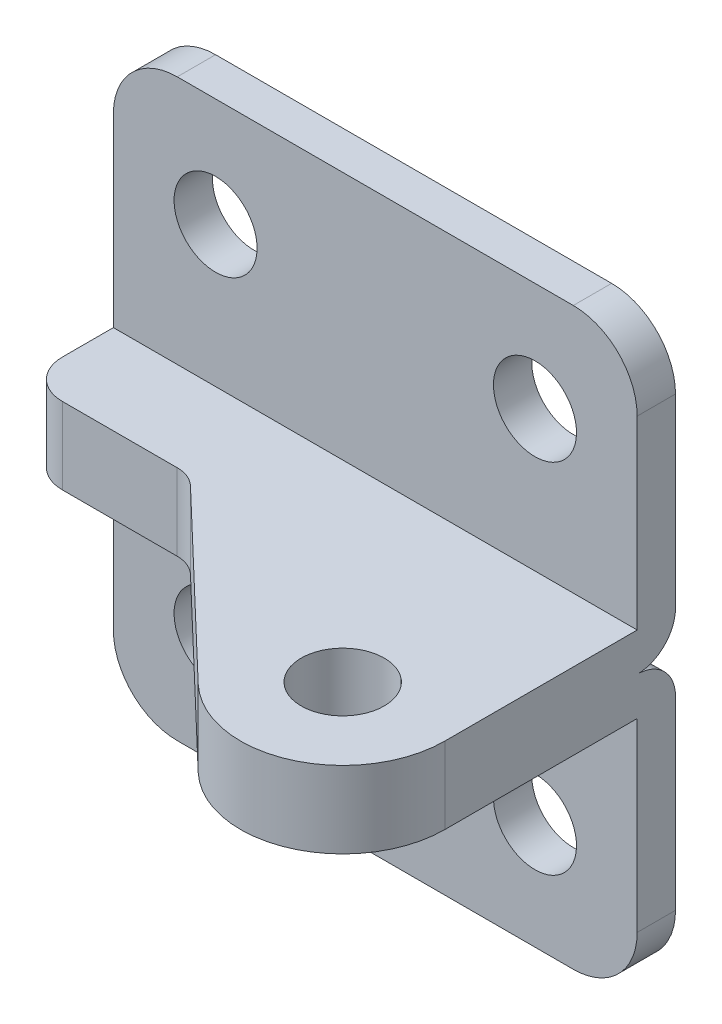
ISO-10303-21;
HEADER;
FILE_DESCRIPTION(('STEP AP214'),'2;1');
FILE_NAME('part.step','',(''),(''),'','','');
FILE_SCHEMA(('AUTOMOTIVE_DESIGN { 1 0 10303 214 1 1 1 1 }'));
ENDSEC;
DATA;
#1=APPLICATION_CONTEXT('core data for automotive mechanical design processes');
#2=APPLICATION_PROTOCOL_DEFINITION('international standard','automotive_design',2000,#1);
#3=PRODUCT_CONTEXT('',#1,'mechanical');
#4=PRODUCT('Part','Part','',(#3));
#5=PRODUCT_RELATED_PRODUCT_CATEGORY('part','',(#4));
#6=PRODUCT_DEFINITION_FORMATION('','',#4);
#7=PRODUCT_DEFINITION_CONTEXT('part definition',#1,'design');
#8=PRODUCT_DEFINITION('design','',#6,#7);
#9=PRODUCT_DEFINITION_SHAPE('','',#8);
#10=(LENGTH_UNIT() NAMED_UNIT(*) SI_UNIT(.MILLI.,.METRE.));
#11=(NAMED_UNIT(*) PLANE_ANGLE_UNIT() SI_UNIT($,.RADIAN.));
#12=(NAMED_UNIT(*) SI_UNIT($,.STERADIAN.) SOLID_ANGLE_UNIT());
#13=UNCERTAINTY_MEASURE_WITH_UNIT(LENGTH_MEASURE(1.E-05),#10,'distance_accuracy_value','');
#14=(GEOMETRIC_REPRESENTATION_CONTEXT(3) GLOBAL_UNCERTAINTY_ASSIGNED_CONTEXT((#13)) GLOBAL_UNIT_ASSIGNED_CONTEXT((#10,
#11,#12)) REPRESENTATION_CONTEXT('',''));
#15=CARTESIAN_POINT('',(0.,0.,0.));
#16=DIRECTION('',(0.,0.,1.));
#17=DIRECTION('',(1.,0.,0.));
#18=AXIS2_PLACEMENT_3D('',#15,#16,#17);
#19=CARTESIAN_POINT('',(19.4722944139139,17.,23.8331194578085));
#20=DIRECTION('',(0.690963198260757,0.,-0.722889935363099));
#21=DIRECTION('',(0.722889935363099,0.,0.690963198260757));
#22=AXIS2_PLACEMENT_3D('',#19,#20,#21);
#23=PLANE('',#22);
#24=DIRECTION('',(0.,-1.,0.));
#25=VECTOR('',#24,1.);
#26=CARTESIAN_POINT('',(19.4722944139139,17.,23.8331194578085));
#27=LINE('',#26,#25);
#28=CARTESIAN_POINT('',(19.4722944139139,17.,23.8331194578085));
#29=VERTEX_POINT('',#28);
#30=CARTESIAN_POINT('',(19.4722944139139,11.0000000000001,23.8331194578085));
#31=VERTEX_POINT('',#30);
#32=EDGE_CURVE('E9',#29,#31,#27,.T.);
#33=ORIENTED_EDGE('',*,*,#32,.F.);
#34=DIRECTION('',(0.722889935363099,0.,0.690963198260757));
#35=VECTOR('',#34,1.);
#36=CARTESIAN_POINT('',(19.4722944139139,17.,23.8331194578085));
#37=LINE('',#36,#35);
#38=CARTESIAN_POINT('',(5.7247856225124,17.,10.6927751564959));
#39=VERTEX_POINT('',#38);
#40=EDGE_CURVE('E406',#39,#29,#37,.T.);
#41=ORIENTED_EDGE('',*,*,#40,.F.);
#42=DIRECTION('',(0.,-1.,0.));
#43=VECTOR('',#42,1.);
#44=CARTESIAN_POINT('',(5.7247856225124,17.,10.6927751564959));
#45=LINE('',#44,#43);
#46=CARTESIAN_POINT('',(5.7247856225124,11.,10.692775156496));
#47=VERTEX_POINT('',#46);
#48=EDGE_CURVE('E24',#39,#47,#45,.T.);
#49=ORIENTED_EDGE('',*,*,#48,.T.);
#50=DIRECTION('',(0.722889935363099,0.,0.690963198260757));
#51=VECTOR('',#50,1.);
#52=CARTESIAN_POINT('',(19.4722944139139,11.0000000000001,23.8331194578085));
#53=LINE('',#52,#51);
#54=EDGE_CURVE('E174',#47,#31,#53,.T.);
#55=ORIENTED_EDGE('',*,*,#54,.T.);
#56=EDGE_LOOP('',(#33,#41,#49,#55));
#57=FACE_BOUND('',#56,.T.);
#58=ADVANCED_FACE('F14',(#57),#23,.F.);
#59=CARTESIAN_POINT('',(3.9973776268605,17.,12.4999999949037));
#60=DIRECTION('',(0.,-1.,0.));
#61=DIRECTION('',(1.,0.,0.));
#62=AXIS2_PLACEMENT_3D('',#59,#60,#61);
#63=CYLINDRICAL_SURFACE('',#62,2.5);
#64=ORIENTED_EDGE('',*,*,#48,.F.);
#65=CARTESIAN_POINT('',(3.9973776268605,17.,12.4999999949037));
#66=DIRECTION('',(0.,-1.,0.));
#67=DIRECTION('',(-1.,0.,0.));
#68=AXIS2_PLACEMENT_3D('',#65,#66,#67);
#69=CIRCLE('',#68,2.5);
#70=CARTESIAN_POINT('',(3.9973776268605,17.,9.9999999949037));
#71=VERTEX_POINT('',#70);
#72=EDGE_CURVE('E413',#71,#39,#69,.T.);
#73=ORIENTED_EDGE('',*,*,#72,.F.);
#74=DIRECTION('',(0.,-1.,0.));
#75=VECTOR('',#74,1.);
#76=CARTESIAN_POINT('',(3.9973776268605,17.,9.9999999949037));
#77=LINE('',#76,#75);
#78=CARTESIAN_POINT('',(3.9973776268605,11.,9.99999999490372));
#79=VERTEX_POINT('',#78);
#80=EDGE_CURVE('E221',#71,#79,#77,.T.);
#81=ORIENTED_EDGE('',*,*,#80,.T.);
#82=CARTESIAN_POINT('',(3.9973776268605,11.,12.4999999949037));
#83=DIRECTION('',(0.,-1.,0.));
#84=DIRECTION('',(-1.,0.,0.));
#85=AXIS2_PLACEMENT_3D('',#82,#83,#84);
#86=CIRCLE('',#85,2.5);
#87=EDGE_CURVE('E182',#79,#47,#86,.T.);
#88=ORIENTED_EDGE('',*,*,#87,.T.);
#89=EDGE_LOOP('',(#64,#73,#81,#88));
#90=FACE_BOUND('',#89,.T.);
#91=ADVANCED_FACE('F430',(#90),#63,.F.);
#92=CARTESIAN_POINT('',(3.9973776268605,17.,9.9999999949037));
#93=DIRECTION('',(0.,0.,-1.));
#94=DIRECTION('',(1.,0.,0.));
#95=AXIS2_PLACEMENT_3D('',#92,#93,#94);
#96=PLANE('',#95);
#97=ORIENTED_EDGE('',*,*,#80,.F.);
#98=DIRECTION('',(1.,0.,0.));
#99=VECTOR('',#98,1.);
#100=CARTESIAN_POINT('',(3.9973776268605,17.,9.9999999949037));
#101=LINE('',#100,#99);
#102=CARTESIAN_POINT('',(-5.,17.,9.9999999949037));
#103=VERTEX_POINT('',#102);
#104=EDGE_CURVE('E382',#103,#71,#101,.T.);
#105=ORIENTED_EDGE('',*,*,#104,.F.);
#106=DIRECTION('',(0.,-1.,0.));
#107=VECTOR('',#106,1.);
#108=CARTESIAN_POINT('',(-5.,17.,9.9999999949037));
#109=LINE('',#108,#107);
#110=CARTESIAN_POINT('',(-5.,11.,9.99999999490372));
#111=VERTEX_POINT('',#110);
#112=EDGE_CURVE('E224',#103,#111,#109,.T.);
#113=ORIENTED_EDGE('',*,*,#112,.T.);
#114=DIRECTION('',(1.,0.,0.));
#115=VECTOR('',#114,1.);
#116=CARTESIAN_POINT('',(3.9973776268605,11.,9.99999999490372));
#117=LINE('',#116,#115);
#118=EDGE_CURVE('E145',#111,#79,#117,.T.);
#119=ORIENTED_EDGE('',*,*,#118,.T.);
#120=EDGE_LOOP('',(#97,#105,#113,#119));
#121=FACE_BOUND('',#120,.T.);
#122=ADVANCED_FACE('F218',(#121),#96,.F.);
#123=CARTESIAN_POINT('',(-5.,17.,6.9999999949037));
#124=DIRECTION('',(0.,-1.,0.));
#125=DIRECTION('',(1.,0.,0.));
#126=AXIS2_PLACEMENT_3D('',#123,#124,#125);
#127=CYLINDRICAL_SURFACE('',#126,3.);
#128=ORIENTED_EDGE('',*,*,#112,.F.);
#129=CARTESIAN_POINT('',(-5.,17.,6.9999999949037));
#130=DIRECTION('',(0.,1.,0.));
#131=DIRECTION('',(1.,0.,0.));
#132=AXIS2_PLACEMENT_3D('',#129,#130,#131);
#133=CIRCLE('',#132,3.);
#134=CARTESIAN_POINT('',(-8.,17.,6.9999999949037));
#135=VERTEX_POINT('',#134);
#136=EDGE_CURVE('E234',#135,#103,#133,.T.);
#137=ORIENTED_EDGE('',*,*,#136,.F.);
#138=DIRECTION('',(0.,-1.,0.));
#139=VECTOR('',#138,1.);
#140=CARTESIAN_POINT('',(-8.,17.,6.9999999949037));
#141=LINE('',#140,#139);
#142=CARTESIAN_POINT('',(-8.,11.,6.99999999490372));
#143=VERTEX_POINT('',#142);
#144=EDGE_CURVE('E232',#135,#143,#141,.T.);
#145=ORIENTED_EDGE('',*,*,#144,.T.);
#146=CARTESIAN_POINT('',(-5.,11.,6.99999999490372));
#147=DIRECTION('',(0.,1.,0.));
#148=DIRECTION('',(1.,0.,0.));
#149=AXIS2_PLACEMENT_3D('',#146,#147,#148);
#150=CIRCLE('',#149,3.);
#151=EDGE_CURVE('E140',#143,#111,#150,.T.);
#152=ORIENTED_EDGE('',*,*,#151,.T.);
#153=EDGE_LOOP('',(#128,#137,#145,#152));
#154=FACE_BOUND('',#153,.T.);
#155=ADVANCED_FACE('F228',(#154),#127,.T.);
#156=CARTESIAN_POINT('',(25.,17.,18.0499999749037));
#157=DIRECTION('',(0.,-1.,0.));
#158=DIRECTION('',(1.,0.,0.));
#159=AXIS2_PLACEMENT_3D('',#156,#157,#158);
#160=CYLINDRICAL_SURFACE('',#159,8.);
#161=DIRECTION('',(0.,-1.,0.));
#162=VECTOR('',#161,1.);
#163=CARTESIAN_POINT('',(33.,17.,18.0499999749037));
#164=LINE('',#163,#162);
#165=CARTESIAN_POINT('',(33.,17.,18.0499999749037));
#166=VERTEX_POINT('',#165);
#167=CARTESIAN_POINT('',(33.,11.,18.0499999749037));
#168=VERTEX_POINT('',#167);
#169=EDGE_CURVE('E237',#166,#168,#164,.T.);
#170=ORIENTED_EDGE('',*,*,#169,.F.);
#171=CARTESIAN_POINT('',(25.,17.,18.0499999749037));
#172=DIRECTION('',(0.,1.,0.));
#173=DIRECTION('',(-1.,0.,0.));
#174=AXIS2_PLACEMENT_3D('',#171,#172,#173);
#175=CIRCLE('',#174,8.);
#176=EDGE_CURVE('E403',#29,#166,#175,.T.);
#177=ORIENTED_EDGE('',*,*,#176,.F.);
#178=ORIENTED_EDGE('',*,*,#32,.T.);
#179=CARTESIAN_POINT('',(25.,11.,18.0499999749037));
#180=DIRECTION('',(0.,1.,0.));
#181=DIRECTION('',(-1.,0.,0.));
#182=AXIS2_PLACEMENT_3D('',#179,#180,#181);
#183=CIRCLE('',#182,8.);
#184=EDGE_CURVE('E170',#31,#168,#183,.T.);
#185=ORIENTED_EDGE('',*,*,#184,.T.);
#186=EDGE_LOOP('',(#170,#177,#178,#185));
#187=FACE_BOUND('',#186,.T.);
#188=ADVANCED_FACE('F518',(#187),#160,.T.);
#189=CARTESIAN_POINT('',(25.,14.,18.0499999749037));
#190=DIRECTION('',(0.,-1.,0.));
#191=DIRECTION('',(1.,0.,0.));
#192=AXIS2_PLACEMENT_3D('',#189,#190,#191);
#193=CYLINDRICAL_SURFACE('',#192,3.25);
#194=CARTESIAN_POINT('',(25.,11.,18.0499999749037));
#195=DIRECTION('',(0.,-1.,0.));
#196=DIRECTION('',(1.,0.,0.));
#197=AXIS2_PLACEMENT_3D('',#194,#195,#196);
#198=CIRCLE('',#197,3.25);
#199=CARTESIAN_POINT('',(28.25,11.,18.0499999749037));
#200=VERTEX_POINT('',#199);
#201=EDGE_CURVE('E18',#200,#200,#198,.T.);
#202=ORIENTED_EDGE('',*,*,#201,.T.);
#203=EDGE_LOOP('',(#202));
#204=FACE_BOUND('',#203,.T.);
#205=CARTESIAN_POINT('',(25.,17.,18.0499999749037));
#206=DIRECTION('',(0.,-1.,0.));
#207=DIRECTION('',(1.,0.,0.));
#208=AXIS2_PLACEMENT_3D('',#205,#206,#207);
#209=CIRCLE('',#208,3.25);
#210=CARTESIAN_POINT('',(28.25,17.,18.0499999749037));
#211=VERTEX_POINT('',#210);
#212=EDGE_CURVE('E423',#211,#211,#209,.T.);
#213=ORIENTED_EDGE('',*,*,#212,.F.);
#214=EDGE_LOOP('',(#213));
#215=FACE_BOUND('',#214,.T.);
#216=ADVANCED_FACE('F521',(#204,#215),#193,.F.);
#217=CARTESIAN_POINT('',(-8.,10.6440201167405,2.99978539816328));
#218=DIRECTION('',(1.,0.,0.));
#219=DIRECTION('',(0.,0.,1.));
#220=AXIS2_PLACEMENT_3D('',#217,#218,#219);
#221=PLANE('',#220);
#222=ORIENTED_EDGE('',*,*,#144,.F.);
#223=DIRECTION('',(0.,0.,1.));
#224=VECTOR('',#223,1.);
#225=CARTESIAN_POINT('',(-8.,17.,6.9999999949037));
#226=LINE('',#225,#224);
#227=CARTESIAN_POINT('',(-8.,17.,2.9999999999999));
#228=VERTEX_POINT('',#227);
#229=EDGE_CURVE('E357',#228,#135,#226,.T.);
#230=ORIENTED_EDGE('',*,*,#229,.F.);
#231=DIRECTION('',(0.,-1.,0.));
#232=VECTOR('',#231,1.);
#233=CARTESIAN_POINT('',(-8.,10.6438055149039,2.99999999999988));
#234=LINE('',#233,#232);
#235=CARTESIAN_POINT('',(-8.,31.4999999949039,2.9999999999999));
#236=VERTEX_POINT('',#235);
#237=EDGE_CURVE('E367',#236,#228,#234,.T.);
#238=ORIENTED_EDGE('',*,*,#237,.F.);
#239=DIRECTION('',(0.,0.,1.));
#240=VECTOR('',#239,1.);
#241=CARTESIAN_POINT('',(-8.,31.4999999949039,-1.12757025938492E-13));
#242=LINE('',#241,#240);
#243=CARTESIAN_POINT('',(-8.,31.4999999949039,-1.12757025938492E-13));
#244=VERTEX_POINT('',#243);
#245=EDGE_CURVE('E374',#244,#236,#242,.T.);
#246=ORIENTED_EDGE('',*,*,#245,.F.);
#247=DIRECTION('',(0.,-1.,0.));
#248=VECTOR('',#247,1.);
#249=CARTESIAN_POINT('',(-8.,10.6438055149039,-1.38777878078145E-13));
#250=LINE('',#249,#248);
#251=CARTESIAN_POINT('',(-8.,17.,-1.00613961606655E-13));
#252=VERTEX_POINT('',#251);
#253=EDGE_CURVE('E426',#244,#252,#250,.T.);
#254=ORIENTED_EDGE('',*,*,#253,.T.);
#255=CARTESIAN_POINT('',(-8.,17.,2.9999999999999));
#256=DIRECTION('',(-1.,0.,0.));
#257=DIRECTION('',(0.,-1.,0.));
#258=AXIS2_PLACEMENT_3D('',#255,#256,#257);
#259=CIRCLE('',#258,3.);
#260=CARTESIAN_POINT('',(-8.,14.,2.99999999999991));
#261=VERTEX_POINT('',#260);
#262=EDGE_CURVE('E289',#252,#261,#259,.T.);
#263=ORIENTED_EDGE('',*,*,#262,.T.);
#264=CARTESIAN_POINT('',(-8.,11.,2.99999999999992));
#265=DIRECTION('',(1.,0.,0.));
#266=DIRECTION('',(0.,1.,0.));
#267=AXIS2_PLACEMENT_3D('',#264,#265,#266);
#268=CIRCLE('',#267,3.);
#269=CARTESIAN_POINT('',(-8.,11.,0.));
#270=VERTEX_POINT('',#269);
#271=EDGE_CURVE('E161',#270,#261,#268,.T.);
#272=ORIENTED_EDGE('',*,*,#271,.F.);
#273=DIRECTION('',(0.,1.,0.));
#274=VECTOR('',#273,1.);
#275=CARTESIAN_POINT('',(-8.,17.3561944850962,-1.6306400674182E-13));
#276=LINE('',#275,#274);
#277=CARTESIAN_POINT('',(-8.,-3.49999999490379,0.));
#278=VERTEX_POINT('',#277);
#279=EDGE_CURVE('E243',#278,#270,#276,.T.);
#280=ORIENTED_EDGE('',*,*,#279,.F.);
#281=DIRECTION('',(0.,0.,1.));
#282=VECTOR('',#281,1.);
#283=CARTESIAN_POINT('',(-8.,-3.49999999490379,0.));
#284=LINE('',#283,#282);
#285=CARTESIAN_POINT('',(-8.,-3.49999999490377,3.));
#286=VERTEX_POINT('',#285);
#287=EDGE_CURVE('E131',#278,#286,#284,.T.);
#288=ORIENTED_EDGE('',*,*,#287,.T.);
#289=DIRECTION('',(0.,1.,0.));
#290=VECTOR('',#289,1.);
#291=CARTESIAN_POINT('',(-8.,17.3561944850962,2.99999999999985));
#292=LINE('',#291,#290);
#293=CARTESIAN_POINT('',(-8.,11.,2.99999999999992));
#294=VERTEX_POINT('',#293);
#295=EDGE_CURVE('E113',#286,#294,#292,.T.);
#296=ORIENTED_EDGE('',*,*,#295,.T.);
#297=DIRECTION('',(0.,0.,1.));
#298=VECTOR('',#297,1.);
#299=CARTESIAN_POINT('',(-8.,11.,6.99999999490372));
#300=LINE('',#299,#298);
#301=EDGE_CURVE('E122',#294,#143,#300,.T.);
#302=ORIENTED_EDGE('',*,*,#301,.T.);
#303=EDGE_LOOP('',(#222,#230,#238,#246,#254,#263,#272,#280,#288,#296,#302));
#304=FACE_BOUND('',#303,.T.);
#305=ADVANCED_FACE('F128',(#304),#221,.F.);
#306=CARTESIAN_POINT('',(33.,36.5002145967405,2.99978539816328));
#307=DIRECTION('',(-1.,0.,0.));
#308=DIRECTION('',(0.,0.,1.));
#309=AXIS2_PLACEMENT_3D('',#306,#307,#308);
#310=PLANE('',#309);
#311=CARTESIAN_POINT('',(33.,11.,2.99999999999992));
#312=DIRECTION('',(1.,0.,0.));
#313=DIRECTION('',(0.,1.,0.));
#314=AXIS2_PLACEMENT_3D('',#311,#312,#313);
#315=CIRCLE('',#314,3.);
#316=CARTESIAN_POINT('',(33.,11.,0.));
#317=VERTEX_POINT('',#316);
#318=CARTESIAN_POINT('',(33.,14.0000001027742,3.00000000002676));
#319=VERTEX_POINT('',#318);
#320=EDGE_CURVE('E165',#317,#319,#315,.T.);
#321=ORIENTED_EDGE('',*,*,#320,.T.);
#322=CARTESIAN_POINT('',(33.,17.,2.9999999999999));
#323=DIRECTION('',(-1.,0.,0.));
#324=DIRECTION('',(0.,-1.,0.));
#325=AXIS2_PLACEMENT_3D('',#322,#323,#324);
#326=CIRCLE('',#325,3.);
#327=CARTESIAN_POINT('',(33.,17.,-1.00613961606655E-13));
#328=VERTEX_POINT('',#327);
#329=EDGE_CURVE('E33',#328,#319,#326,.T.);
#330=ORIENTED_EDGE('',*,*,#329,.F.);
#331=DIRECTION('',(0.,1.,0.));
#332=VECTOR('',#331,1.);
#333=CARTESIAN_POINT('',(33.,36.4999999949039,-1.3010426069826E-13));
#334=LINE('',#333,#332);
#335=CARTESIAN_POINT('',(33.,31.4999999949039,-1.12757025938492E-13));
#336=VERTEX_POINT('',#335);
#337=EDGE_CURVE('E422',#328,#336,#334,.T.);
#338=ORIENTED_EDGE('',*,*,#337,.T.);
#339=DIRECTION('',(0.,0.,-1.));
#340=VECTOR('',#339,1.);
#341=CARTESIAN_POINT('',(33.,31.4999999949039,-1.12757025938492E-13));
#342=LINE('',#341,#340);
#343=CARTESIAN_POINT('',(33.,31.4999999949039,2.9999999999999));
#344=VERTEX_POINT('',#343);
#345=EDGE_CURVE('E389',#344,#336,#342,.T.);
#346=ORIENTED_EDGE('',*,*,#345,.F.);
#347=DIRECTION('',(0.,1.,0.));
#348=VECTOR('',#347,1.);
#349=CARTESIAN_POINT('',(33.,36.4999999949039,2.99999999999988));
#350=LINE('',#349,#348);
#351=CARTESIAN_POINT('',(33.,17.,2.9999999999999));
#352=VERTEX_POINT('',#351);
#353=EDGE_CURVE('E375',#352,#344,#350,.T.);
#354=ORIENTED_EDGE('',*,*,#353,.F.);
#355=DIRECTION('',(0.,0.,-1.));
#356=VECTOR('',#355,1.);
#357=CARTESIAN_POINT('',(33.,17.,-18.8561944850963));
#358=LINE('',#357,#356);
#359=EDGE_CURVE('E360',#166,#352,#358,.T.);
#360=ORIENTED_EDGE('',*,*,#359,.F.);
#361=ORIENTED_EDGE('',*,*,#169,.T.);
#362=DIRECTION('',(0.,0.,-1.));
#363=VECTOR('',#362,1.);
#364=CARTESIAN_POINT('',(33.,11.,-18.8561944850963));
#365=LINE('',#364,#363);
#366=CARTESIAN_POINT('',(33.,11.,2.99999999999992));
#367=VERTEX_POINT('',#366);
#368=EDGE_CURVE('E123',#168,#367,#365,.T.);
#369=ORIENTED_EDGE('',*,*,#368,.T.);
#370=DIRECTION('',(0.,-1.,0.));
#371=VECTOR('',#370,1.);
#372=CARTESIAN_POINT('',(33.,-8.49999999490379,3.00000000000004));
#373=LINE('',#372,#371);
#374=CARTESIAN_POINT('',(33.,-3.49999999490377,3.));
#375=VERTEX_POINT('',#374);
#376=EDGE_CURVE('E117',#367,#375,#373,.T.);
#377=ORIENTED_EDGE('',*,*,#376,.T.);
#378=DIRECTION('',(0.,0.,-1.));
#379=VECTOR('',#378,1.);
#380=CARTESIAN_POINT('',(33.,-3.49999999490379,0.));
#381=LINE('',#380,#379);
#382=CARTESIAN_POINT('',(33.,-3.49999999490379,0.));
#383=VERTEX_POINT('',#382);
#384=EDGE_CURVE('E152',#375,#383,#381,.T.);
#385=ORIENTED_EDGE('',*,*,#384,.T.);
#386=DIRECTION('',(0.,-1.,0.));
#387=VECTOR('',#386,1.);
#388=CARTESIAN_POINT('',(33.,-8.4999999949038,0.));
#389=LINE('',#388,#387);
#390=EDGE_CURVE('E190',#317,#383,#389,.T.);
#391=ORIENTED_EDGE('',*,*,#390,.F.);
#392=EDGE_LOOP('',(#321,#330,#338,#346,#354,#360,#361,#369,#377,#385,#391));
#393=FACE_BOUND('',#392,.T.);
#394=ADVANCED_FACE('F258',(#393),#310,.F.);
#395=CARTESIAN_POINT('',(-3.,-3.49999999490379,0.));
#396=DIRECTION('',(0.,0.,1.));
#397=DIRECTION('',(1.,0.,0.));
#398=AXIS2_PLACEMENT_3D('',#395,#396,#397);
#399=CYLINDRICAL_SURFACE('',#398,5.);
#400=CARTESIAN_POINT('',(-3.,-3.49999999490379,0.));
#401=DIRECTION('',(0.,0.,-1.));
#402=DIRECTION('',(-1.,0.,0.));
#403=AXIS2_PLACEMENT_3D('',#400,#401,#402);
#404=CIRCLE('',#403,5.);
#405=CARTESIAN_POINT('',(-3.,-8.4999999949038,0.));
#406=VERTEX_POINT('',#405);
#407=EDGE_CURVE('E159',#406,#278,#404,.T.);
#408=ORIENTED_EDGE('',*,*,#407,.F.);
#409=DIRECTION('',(0.,0.,-1.));
#410=VECTOR('',#409,1.);
#411=CARTESIAN_POINT('',(-3.,-8.4999999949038,0.));
#412=LINE('',#411,#410);
#413=CARTESIAN_POINT('',(-3.,-8.49999999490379,3.00000000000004));
#414=VERTEX_POINT('',#413);
#415=EDGE_CURVE('E149',#414,#406,#412,.T.);
#416=ORIENTED_EDGE('',*,*,#415,.F.);
#417=CARTESIAN_POINT('',(-3.,-3.49999999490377,3.));
#418=DIRECTION('',(0.,0.,1.));
#419=DIRECTION('',(-1.,0.,0.));
#420=AXIS2_PLACEMENT_3D('',#417,#418,#419);
#421=CIRCLE('',#420,5.);
#422=EDGE_CURVE('E169',#286,#414,#421,.T.);
#423=ORIENTED_EDGE('',*,*,#422,.F.);
#424=ORIENTED_EDGE('',*,*,#287,.F.);
#425=EDGE_LOOP('',(#408,#416,#423,#424));
#426=FACE_BOUND('',#425,.T.);
#427=ADVANCED_FACE('F283',(#426),#399,.T.);
#428=CARTESIAN_POINT('',(-8.,-8.4999999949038,0.));
#429=DIRECTION('',(0.,1.,0.));
#430=DIRECTION('',(-1.,0.,0.));
#431=AXIS2_PLACEMENT_3D('',#428,#429,#430);
#432=PLANE('',#431);
#433=DIRECTION('',(-1.,0.,0.));
#434=VECTOR('',#433,1.);
#435=CARTESIAN_POINT('',(-8.,-8.4999999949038,0.));
#436=LINE('',#435,#434);
#437=CARTESIAN_POINT('',(28.,-8.4999999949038,0.));
#438=VERTEX_POINT('',#437);
#439=EDGE_CURVE('E186',#438,#406,#436,.T.);
#440=ORIENTED_EDGE('',*,*,#439,.F.);
#441=DIRECTION('',(0.,0.,1.));
#442=VECTOR('',#441,1.);
#443=CARTESIAN_POINT('',(28.,-8.4999999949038,0.));
#444=LINE('',#443,#442);
#445=CARTESIAN_POINT('',(28.,-8.49999999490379,3.00000000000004));
#446=VERTEX_POINT('',#445);
#447=EDGE_CURVE('E155',#438,#446,#444,.T.);
#448=ORIENTED_EDGE('',*,*,#447,.T.);
#449=DIRECTION('',(-1.,0.,0.));
#450=VECTOR('',#449,1.);
#451=CARTESIAN_POINT('',(-8.,-8.49999999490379,3.00000000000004));
#452=LINE('',#451,#450);
#453=EDGE_CURVE('E160',#446,#414,#452,.T.);
#454=ORIENTED_EDGE('',*,*,#453,.T.);
#455=ORIENTED_EDGE('',*,*,#415,.T.);
#456=EDGE_LOOP('',(#440,#448,#454,#455));
#457=FACE_BOUND('',#456,.T.);
#458=ADVANCED_FACE('F265',(#457),#432,.F.);
#459=CARTESIAN_POINT('',(28.,-3.49999999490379,0.));
#460=DIRECTION('',(0.,0.,1.));
#461=DIRECTION('',(1.,0.,0.));
#462=AXIS2_PLACEMENT_3D('',#459,#460,#461);
#463=CYLINDRICAL_SURFACE('',#462,5.);
#464=CARTESIAN_POINT('',(28.,-3.49999999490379,0.));
#465=DIRECTION('',(0.,0.,-1.));
#466=DIRECTION('',(-1.,0.,0.));
#467=AXIS2_PLACEMENT_3D('',#464,#465,#466);
#468=CIRCLE('',#467,5.);
#469=EDGE_CURVE('E187',#383,#438,#468,.T.);
#470=ORIENTED_EDGE('',*,*,#469,.F.);
#471=ORIENTED_EDGE('',*,*,#384,.F.);
#472=CARTESIAN_POINT('',(28.,-3.49999999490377,3.));
#473=DIRECTION('',(0.,0.,1.));
#474=DIRECTION('',(-1.,0.,0.));
#475=AXIS2_PLACEMENT_3D('',#472,#473,#474);
#476=CIRCLE('',#475,5.);
#477=EDGE_CURVE('E166',#446,#375,#476,.T.);
#478=ORIENTED_EDGE('',*,*,#477,.F.);
#479=ORIENTED_EDGE('',*,*,#447,.F.);
#480=EDGE_LOOP('',(#470,#471,#478,#479));
#481=FACE_BOUND('',#480,.T.);
#482=ADVANCED_FACE('F263',(#481),#463,.T.);
#483=CARTESIAN_POINT('',(25.,28.4061944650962,2.99999999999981));
#484=DIRECTION('',(0.,0.,-1.));
#485=DIRECTION('',(0.,-1.,0.));
#486=AXIS2_PLACEMENT_3D('',#483,#484,#485);
#487=PLANE('',#486);
#488=CARTESIAN_POINT('',(0.,0.,2.99999999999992));
#489=DIRECTION('',(0.,0.,1.));
#490=DIRECTION('',(0.,1.,0.));
#491=AXIS2_PLACEMENT_3D('',#488,#489,#490);
#492=CIRCLE('',#491,3.25);
#493=CARTESIAN_POINT('',(0.,3.25,2.99999999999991));
#494=VERTEX_POINT('',#493);
#495=EDGE_CURVE('E474',#494,#494,#492,.T.);
#496=ORIENTED_EDGE('',*,*,#495,.F.);
#497=EDGE_LOOP('',(#496));
#498=FACE_BOUND('',#497,.T.);
#499=CARTESIAN_POINT('',(25.,0.,2.99999999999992));
#500=DIRECTION('',(0.,0.,1.));
#501=DIRECTION('',(0.,1.,0.));
#502=AXIS2_PLACEMENT_3D('',#499,#500,#501);
#503=CIRCLE('',#502,3.25);
#504=CARTESIAN_POINT('',(25.,3.25,2.99999999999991));
#505=VERTEX_POINT('',#504);
#506=EDGE_CURVE('E456',#505,#505,#503,.T.);
#507=ORIENTED_EDGE('',*,*,#506,.F.);
#508=EDGE_LOOP('',(#507));
#509=FACE_BOUND('',#508,.T.);
#510=DIRECTION('',(1.,0.,0.));
#511=VECTOR('',#510,1.);
#512=CARTESIAN_POINT('',(25.,11.,2.99999999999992));
#513=LINE('',#512,#511);
#514=EDGE_CURVE('E109',#294,#367,#513,.T.);
#515=ORIENTED_EDGE('',*,*,#514,.F.);
#516=ORIENTED_EDGE('',*,*,#295,.F.);
#517=ORIENTED_EDGE('',*,*,#422,.T.);
#518=ORIENTED_EDGE('',*,*,#453,.F.);
#519=ORIENTED_EDGE('',*,*,#477,.T.);
#520=ORIENTED_EDGE('',*,*,#376,.F.);
#521=EDGE_LOOP('',(#515,#516,#517,#518,#519,#520));
#522=FACE_BOUND('',#521,.T.);
#523=ADVANCED_FACE('F111',(#498,#509,#522),#487,.F.);
#524=CARTESIAN_POINT('',(25.,28.4061944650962,-2.02962646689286E-13));
#525=DIRECTION('',(0.,0.,-1.));
#526=DIRECTION('',(0.,-1.,0.));
#527=AXIS2_PLACEMENT_3D('',#524,#525,#526);
#528=PLANE('',#527);
#529=CARTESIAN_POINT('',(0.,0.,-1.6826817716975E-13));
#530=DIRECTION('',(0.,0.,1.));
#531=DIRECTION('',(0.,1.,0.));
#532=AXIS2_PLACEMENT_3D('',#529,#530,#531);
#533=CIRCLE('',#532,3.25);
#534=CARTESIAN_POINT('',(0.,3.25,-1.68585382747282E-13));
#535=VERTEX_POINT('',#534);
#536=EDGE_CURVE('E459',#535,#535,#533,.T.);
#537=ORIENTED_EDGE('',*,*,#536,.T.);
#538=EDGE_LOOP('',(#537));
#539=FACE_BOUND('',#538,.T.);
#540=CARTESIAN_POINT('',(25.,0.,-1.6826817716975E-13));
#541=DIRECTION('',(0.,0.,1.));
#542=DIRECTION('',(0.,1.,0.));
#543=AXIS2_PLACEMENT_3D('',#540,#541,#542);
#544=CIRCLE('',#543,3.25);
#545=CARTESIAN_POINT('',(25.,3.25,-1.68585382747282E-13));
#546=VERTEX_POINT('',#545);
#547=EDGE_CURVE('E451',#546,#546,#544,.T.);
#548=ORIENTED_EDGE('',*,*,#547,.T.);
#549=EDGE_LOOP('',(#548));
#550=FACE_BOUND('',#549,.T.);
#551=ORIENTED_EDGE('',*,*,#279,.T.);
#552=DIRECTION('',(1.,0.,0.));
#553=VECTOR('',#552,1.);
#554=CARTESIAN_POINT('',(25.,11.,0.));
#555=LINE('',#554,#553);
#556=EDGE_CURVE('E198',#270,#317,#555,.T.);
#557=ORIENTED_EDGE('',*,*,#556,.T.);
#558=ORIENTED_EDGE('',*,*,#390,.T.);
#559=ORIENTED_EDGE('',*,*,#469,.T.);
#560=ORIENTED_EDGE('',*,*,#439,.T.);
#561=ORIENTED_EDGE('',*,*,#407,.T.);
#562=EDGE_LOOP('',(#551,#557,#558,#559,#560,#561));
#563=FACE_BOUND('',#562,.T.);
#564=ADVANCED_FACE('F254',(#539,#550,#563),#528,.T.);
#565=CARTESIAN_POINT('',(33.,11.,2.99999999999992));
#566=DIRECTION('',(1.,0.,0.));
#567=DIRECTION('',(0.,1.,0.));
#568=AXIS2_PLACEMENT_3D('',#565,#566,#567);
#569=CYLINDRICAL_SURFACE('',#568,3.);
#570=ORIENTED_EDGE('',*,*,#320,.F.);
#571=ORIENTED_EDGE('',*,*,#556,.F.);
#572=ORIENTED_EDGE('',*,*,#271,.T.);
#573=DIRECTION('',(1.,0.,0.));
#574=VECTOR('',#573,1.);
#575=CARTESIAN_POINT('',(12.5,14.,2.99999999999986));
#576=LINE('',#575,#574);
#577=EDGE_CURVE('E249',#261,#319,#576,.T.);
#578=ORIENTED_EDGE('',*,*,#577,.T.);
#579=EDGE_LOOP('',(#570,#571,#572,#578));
#580=FACE_BOUND('',#579,.T.);
#581=ADVANCED_FACE('F16',(#580),#569,.T.);
#582=CARTESIAN_POINT('',(25.,11.,18.0499999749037));
#583=DIRECTION('',(0.,1.,0.));
#584=DIRECTION('',(-1.,0.,0.));
#585=AXIS2_PLACEMENT_3D('',#582,#583,#584);
#586=PLANE('',#585);
#587=ORIENTED_EDGE('',*,*,#301,.F.);
#588=ORIENTED_EDGE('',*,*,#514,.T.);
#589=ORIENTED_EDGE('',*,*,#368,.F.);
#590=ORIENTED_EDGE('',*,*,#184,.F.);
#591=ORIENTED_EDGE('',*,*,#54,.F.);
#592=ORIENTED_EDGE('',*,*,#87,.F.);
#593=ORIENTED_EDGE('',*,*,#118,.F.);
#594=ORIENTED_EDGE('',*,*,#151,.F.);
#595=EDGE_LOOP('',(#587,#588,#589,#590,#591,#592,#593,#594));
#596=FACE_BOUND('',#595,.T.);
#597=ORIENTED_EDGE('',*,*,#201,.F.);
#598=EDGE_LOOP('',(#597));
#599=FACE_BOUND('',#598,.T.);
#600=ADVANCED_FACE('F136',(#596,#599),#586,.F.);
#601=CARTESIAN_POINT('',(-3.,31.4999999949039,-1.12757025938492E-13));
#602=DIRECTION('',(0.,0.,1.));
#603=DIRECTION('',(1.,0.,0.));
#604=AXIS2_PLACEMENT_3D('',#601,#602,#603);
#605=CYLINDRICAL_SURFACE('',#604,5.);
#606=CARTESIAN_POINT('',(-3.,31.4999999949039,-1.12757025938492E-13));
#607=DIRECTION('',(0.,0.,1.));
#608=DIRECTION('',(-1.,0.,0.));
#609=AXIS2_PLACEMENT_3D('',#606,#607,#608);
#610=CIRCLE('',#609,5.);
#611=CARTESIAN_POINT('',(-3.,36.4999999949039,-1.3010426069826E-13));
#612=VERTEX_POINT('',#611);
#613=EDGE_CURVE('E396',#612,#244,#610,.T.);
#614=ORIENTED_EDGE('',*,*,#613,.T.);
#615=ORIENTED_EDGE('',*,*,#245,.T.);
#616=CARTESIAN_POINT('',(-3.,31.4999999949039,2.9999999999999));
#617=DIRECTION('',(0.,0.,-1.));
#618=DIRECTION('',(-1.,0.,0.));
#619=AXIS2_PLACEMENT_3D('',#616,#617,#618);
#620=CIRCLE('',#619,5.);
#621=CARTESIAN_POINT('',(-3.,36.4999999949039,2.99999999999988));
#622=VERTEX_POINT('',#621);
#623=EDGE_CURVE('E370',#236,#622,#620,.T.);
#624=ORIENTED_EDGE('',*,*,#623,.T.);
#625=DIRECTION('',(0.,0.,-1.));
#626=VECTOR('',#625,1.);
#627=CARTESIAN_POINT('',(-3.,36.4999999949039,-1.3010426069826E-13));
#628=LINE('',#627,#626);
#629=EDGE_CURVE('E386',#622,#612,#628,.T.);
#630=ORIENTED_EDGE('',*,*,#629,.T.);
#631=EDGE_LOOP('',(#614,#615,#624,#630));
#632=FACE_BOUND('',#631,.T.);
#633=ADVANCED_FACE('F534',(#632),#605,.T.);
#634=CARTESIAN_POINT('',(-8.,36.4999999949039,-1.3010426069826E-13));
#635=DIRECTION('',(0.,-1.,0.));
#636=DIRECTION('',(-1.,0.,0.));
#637=AXIS2_PLACEMENT_3D('',#634,#635,#636);
#638=PLANE('',#637);
#639=DIRECTION('',(-1.,0.,0.));
#640=VECTOR('',#639,1.);
#641=CARTESIAN_POINT('',(-8.,36.4999999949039,-1.3010426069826E-13));
#642=LINE('',#641,#640);
#643=CARTESIAN_POINT('',(28.,36.4999999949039,-1.3010426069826E-13));
#644=VERTEX_POINT('',#643);
#645=EDGE_CURVE('E418',#644,#612,#642,.T.);
#646=ORIENTED_EDGE('',*,*,#645,.T.);
#647=ORIENTED_EDGE('',*,*,#629,.F.);
#648=DIRECTION('',(-1.,0.,0.));
#649=VECTOR('',#648,1.);
#650=CARTESIAN_POINT('',(-8.,36.4999999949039,2.99999999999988));
#651=LINE('',#650,#649);
#652=CARTESIAN_POINT('',(28.,36.4999999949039,2.99999999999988));
#653=VERTEX_POINT('',#652);
#654=EDGE_CURVE('E397',#653,#622,#651,.T.);
#655=ORIENTED_EDGE('',*,*,#654,.F.);
#656=DIRECTION('',(0.,0.,1.));
#657=VECTOR('',#656,1.);
#658=CARTESIAN_POINT('',(28.,36.4999999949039,-1.3010426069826E-13));
#659=LINE('',#658,#657);
#660=EDGE_CURVE('E392',#644,#653,#659,.T.);
#661=ORIENTED_EDGE('',*,*,#660,.F.);
#662=EDGE_LOOP('',(#646,#647,#655,#661));
#663=FACE_BOUND('',#662,.T.);
#664=ADVANCED_FACE('F583',(#663),#638,.F.);
#665=CARTESIAN_POINT('',(28.,31.4999999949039,-1.12757025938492E-13));
#666=DIRECTION('',(0.,0.,1.));
#667=DIRECTION('',(1.,0.,0.));
#668=AXIS2_PLACEMENT_3D('',#665,#666,#667);
#669=CYLINDRICAL_SURFACE('',#668,5.);
#670=CARTESIAN_POINT('',(28.,31.4999999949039,-1.12757025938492E-13));
#671=DIRECTION('',(0.,0.,1.));
#672=DIRECTION('',(-1.,0.,0.));
#673=AXIS2_PLACEMENT_3D('',#670,#671,#672);
#674=CIRCLE('',#673,5.);
#675=EDGE_CURVE('E419',#336,#644,#674,.T.);
#676=ORIENTED_EDGE('',*,*,#675,.T.);
#677=ORIENTED_EDGE('',*,*,#660,.T.);
#678=CARTESIAN_POINT('',(28.,31.4999999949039,2.9999999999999));
#679=DIRECTION('',(0.,0.,-1.));
#680=DIRECTION('',(-1.,0.,0.));
#681=AXIS2_PLACEMENT_3D('',#678,#679,#680);
#682=CIRCLE('',#681,5.);
#683=EDGE_CURVE('E400',#653,#344,#682,.T.);
#684=ORIENTED_EDGE('',*,*,#683,.T.);
#685=ORIENTED_EDGE('',*,*,#345,.T.);
#686=EDGE_LOOP('',(#676,#677,#684,#685));
#687=FACE_BOUND('',#686,.T.);
#688=ADVANCED_FACE('F592',(#687),#669,.T.);
#689=CARTESIAN_POINT('',(25.,-0.406194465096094,2.99999999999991));
#690=DIRECTION('',(0.,0.,-1.));
#691=DIRECTION('',(0.,1.,0.));
#692=AXIS2_PLACEMENT_3D('',#689,#690,#691);
#693=PLANE('',#692);
#694=CARTESIAN_POINT('',(25.,28.,2.99999999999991));
#695=DIRECTION('',(0.,0.,1.));
#696=DIRECTION('',(0.,1.,0.));
#697=AXIS2_PLACEMENT_3D('',#694,#695,#696);
#698=CIRCLE('',#697,3.25);
#699=CARTESIAN_POINT('',(25.,31.25,2.99999999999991));
#700=VERTEX_POINT('',#699);
#701=EDGE_CURVE('E462',#700,#700,#698,.T.);
#702=ORIENTED_EDGE('',*,*,#701,.F.);
#703=EDGE_LOOP('',(#702));
#704=FACE_BOUND('',#703,.T.);
#705=CARTESIAN_POINT('',(0.,28.,2.99999999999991));
#706=DIRECTION('',(0.,0.,1.));
#707=DIRECTION('',(0.,1.,0.));
#708=AXIS2_PLACEMENT_3D('',#705,#706,#707);
#709=CIRCLE('',#708,3.25);
#710=CARTESIAN_POINT('',(0.,31.25,2.99999999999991));
#711=VERTEX_POINT('',#710);
#712=EDGE_CURVE('E468',#711,#711,#709,.T.);
#713=ORIENTED_EDGE('',*,*,#712,.F.);
#714=EDGE_LOOP('',(#713));
#715=FACE_BOUND('',#714,.T.);
#716=DIRECTION('',(1.,0.,0.));
#717=VECTOR('',#716,1.);
#718=CARTESIAN_POINT('',(25.,17.,2.9999999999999));
#719=LINE('',#718,#717);
#720=EDGE_CURVE('E353',#228,#352,#719,.T.);
#721=ORIENTED_EDGE('',*,*,#720,.T.);
#722=ORIENTED_EDGE('',*,*,#353,.T.);
#723=ORIENTED_EDGE('',*,*,#683,.F.);
#724=ORIENTED_EDGE('',*,*,#654,.T.);
#725=ORIENTED_EDGE('',*,*,#623,.F.);
#726=ORIENTED_EDGE('',*,*,#237,.T.);
#727=EDGE_LOOP('',(#721,#722,#723,#724,#725,#726));
#728=FACE_BOUND('',#727,.T.);
#729=ADVANCED_FACE('F368',(#704,#715,#728),#693,.F.);
#730=CARTESIAN_POINT('',(25.,-0.406194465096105,0.));
#731=DIRECTION('',(0.,0.,-1.));
#732=DIRECTION('',(0.,1.,0.));
#733=AXIS2_PLACEMENT_3D('',#730,#731,#732);
#734=PLANE('',#733);
#735=CARTESIAN_POINT('',(25.,28.,-1.71737624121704E-13));
#736=DIRECTION('',(0.,0.,1.));
#737=DIRECTION('',(0.,1.,0.));
#738=AXIS2_PLACEMENT_3D('',#735,#736,#737);
#739=CIRCLE('',#738,3.25);
#740=CARTESIAN_POINT('',(25.,31.25,-1.72054829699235E-13));
#741=VERTEX_POINT('',#740);
#742=EDGE_CURVE('E465',#741,#741,#739,.T.);
#743=ORIENTED_EDGE('',*,*,#742,.T.);
#744=EDGE_LOOP('',(#743));
#745=FACE_BOUND('',#744,.T.);
#746=CARTESIAN_POINT('',(0.,28.,-1.71737624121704E-13));
#747=DIRECTION('',(0.,0.,1.));
#748=DIRECTION('',(0.,1.,0.));
#749=AXIS2_PLACEMENT_3D('',#746,#747,#748);
#750=CIRCLE('',#749,3.25);
#751=CARTESIAN_POINT('',(0.,31.25,-1.72054829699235E-13));
#752=VERTEX_POINT('',#751);
#753=EDGE_CURVE('E471',#752,#752,#750,.T.);
#754=ORIENTED_EDGE('',*,*,#753,.T.);
#755=EDGE_LOOP('',(#754));
#756=FACE_BOUND('',#755,.T.);
#757=ORIENTED_EDGE('',*,*,#253,.F.);
#758=ORIENTED_EDGE('',*,*,#613,.F.);
#759=ORIENTED_EDGE('',*,*,#645,.F.);
#760=ORIENTED_EDGE('',*,*,#675,.F.);
#761=ORIENTED_EDGE('',*,*,#337,.F.);
#762=DIRECTION('',(1.,0.,0.));
#763=VECTOR('',#762,1.);
#764=CARTESIAN_POINT('',(25.,17.,-1.00613961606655E-13));
#765=LINE('',#764,#763);
#766=EDGE_CURVE('E448',#252,#328,#765,.T.);
#767=ORIENTED_EDGE('',*,*,#766,.F.);
#768=EDGE_LOOP('',(#757,#758,#759,#760,#761,#767));
#769=FACE_BOUND('',#768,.T.);
#770=ADVANCED_FACE('F608',(#745,#756,#769),#734,.T.);
#771=CARTESIAN_POINT('',(33.,17.,2.9999999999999));
#772=DIRECTION('',(1.,0.,0.));
#773=DIRECTION('',(0.,-1.,0.));
#774=AXIS2_PLACEMENT_3D('',#771,#772,#773);
#775=CYLINDRICAL_SURFACE('',#774,3.);
#776=ORIENTED_EDGE('',*,*,#329,.T.);
#777=ORIENTED_EDGE('',*,*,#577,.F.);
#778=ORIENTED_EDGE('',*,*,#262,.F.);
#779=ORIENTED_EDGE('',*,*,#766,.T.);
#780=EDGE_LOOP('',(#776,#777,#778,#779));
#781=FACE_BOUND('',#780,.T.);
#782=ADVANCED_FACE('F617',(#781),#775,.T.);
#783=CARTESIAN_POINT('',(25.,17.,18.0499999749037));
#784=DIRECTION('',(0.,-1.,0.));
#785=DIRECTION('',(-1.,0.,0.));
#786=AXIS2_PLACEMENT_3D('',#783,#784,#785);
#787=PLANE('',#786);
#788=ORIENTED_EDGE('',*,*,#229,.T.);
#789=ORIENTED_EDGE('',*,*,#136,.T.);
#790=ORIENTED_EDGE('',*,*,#104,.T.);
#791=ORIENTED_EDGE('',*,*,#72,.T.);
#792=ORIENTED_EDGE('',*,*,#40,.T.);
#793=ORIENTED_EDGE('',*,*,#176,.T.);
#794=ORIENTED_EDGE('',*,*,#359,.T.);
#795=ORIENTED_EDGE('',*,*,#720,.F.);
#796=EDGE_LOOP('',(#788,#789,#790,#791,#792,#793,#794,#795));
#797=FACE_BOUND('',#796,.T.);
#798=ORIENTED_EDGE('',*,*,#212,.T.);
#799=EDGE_LOOP('',(#798));
#800=FACE_BOUND('',#799,.T.);
#801=ADVANCED_FACE('F355',(#797,#800),#787,.F.);
#802=CARTESIAN_POINT('',(0.,28.,-1.71737624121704E-13));
#803=DIRECTION('',(0.,0.,1.));
#804=DIRECTION('',(0.,1.,0.));
#805=AXIS2_PLACEMENT_3D('',#802,#803,#804);
#806=CYLINDRICAL_SURFACE('',#805,3.25);
#807=ORIENTED_EDGE('',*,*,#753,.F.);
#808=EDGE_LOOP('',(#807));
#809=FACE_BOUND('',#808,.T.);
#810=ORIENTED_EDGE('',*,*,#712,.T.);
#811=EDGE_LOOP('',(#810));
#812=FACE_BOUND('',#811,.T.);
#813=ADVANCED_FACE('F502',(#809,#812),#806,.F.);
#814=CARTESIAN_POINT('',(25.,28.,-1.71737624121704E-13));
#815=DIRECTION('',(0.,0.,1.));
#816=DIRECTION('',(0.,1.,0.));
#817=AXIS2_PLACEMENT_3D('',#814,#815,#816);
#818=CYLINDRICAL_SURFACE('',#817,3.25);
#819=ORIENTED_EDGE('',*,*,#742,.F.);
#820=EDGE_LOOP('',(#819));
#821=FACE_BOUND('',#820,.T.);
#822=ORIENTED_EDGE('',*,*,#701,.T.);
#823=EDGE_LOOP('',(#822));
#824=FACE_BOUND('',#823,.T.);
#825=ADVANCED_FACE('F494',(#821,#824),#818,.F.);
#826=CARTESIAN_POINT('',(25.,0.,-1.6826817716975E-13));
#827=DIRECTION('',(0.,0.,1.));
#828=DIRECTION('',(0.,1.,0.));
#829=AXIS2_PLACEMENT_3D('',#826,#827,#828);
#830=CYLINDRICAL_SURFACE('',#829,3.25);
#831=ORIENTED_EDGE('',*,*,#547,.F.);
#832=EDGE_LOOP('',(#831));
#833=FACE_BOUND('',#832,.T.);
#834=ORIENTED_EDGE('',*,*,#506,.T.);
#835=EDGE_LOOP('',(#834));
#836=FACE_BOUND('',#835,.T.);
#837=ADVANCED_FACE('F485',(#833,#836),#830,.F.);
#838=CARTESIAN_POINT('',(0.,0.,-1.6826817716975E-13));
#839=DIRECTION('',(0.,0.,1.));
#840=DIRECTION('',(0.,1.,0.));
#841=AXIS2_PLACEMENT_3D('',#838,#839,#840);
#842=CYLINDRICAL_SURFACE('',#841,3.25);
#843=ORIENTED_EDGE('',*,*,#536,.F.);
#844=EDGE_LOOP('',(#843));
#845=FACE_BOUND('',#844,.T.);
#846=ORIENTED_EDGE('',*,*,#495,.T.);
#847=EDGE_LOOP('',(#846));
#848=FACE_BOUND('',#847,.T.);
#849=ADVANCED_FACE('F482',(#845,#848),#842,.F.);
#850=CLOSED_SHELL('',(#58,#91,#122,#155,#188,#216,#305,#394,#427,#458,#482,#523,#564,#581,#600,
#633,#664,#688,#729,#770,#782,#801,#813,#825,#837,#849));
#851=MANIFOLD_SOLID_BREP('B1',#850);
#852=ADVANCED_BREP_SHAPE_REPRESENTATION('',(#18,#851),#14);
#853=SHAPE_DEFINITION_REPRESENTATION(#9,#852);
ENDSEC;
END-ISO-10303-21;
